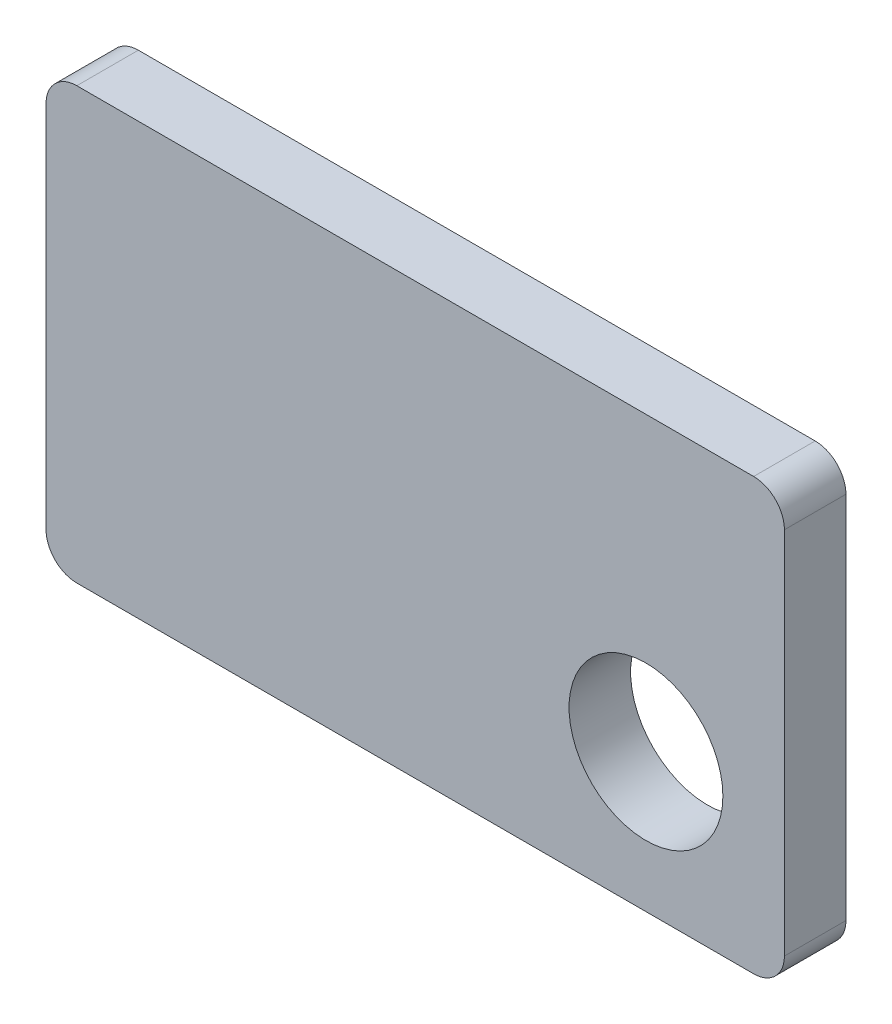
from build123d import *

# Parameters (mm, degrees)
ESQUISSE1_W             = 12
ESQUISSE1_H             = 7
BOSS_EXTRU_1_DEPTH      = 1
CONG_1_R                = 0.5
ENL_V_MAT_EXTRU_1_REACH = 9.018
ESQUISSE2_R             = 1.25


with BuildPart() as part:
    # Esquisse1 → Boss.-Extru.1 (new body)
    with BuildSketch(Plane.XY):
        Rectangle(ESQUISSE1_W, ESQUISSE1_H)
    extrude(amount=BOSS_EXTRU_1_DEPTH)

    # Cong_1
    cong_1_edges = [part.edges().sort_by_distance(p)[0] for p in [
        (6, -3.5, 0.5),
        (-6, -3.5, 0.5),
        (-6, 3.5, 0.5),
        (6, 3.5, 0.5),
    ]]
    fillet(cong_1_edges, radius=CONG_1_R)

    # Esquisse2 → Enl_v. mat.-Extru.1 (cut, up to next)
    with BuildSketch(Plane.XY.offset(1), mode=Mode.PRIVATE) as enl_v_mat_extru_1_sk1:
        with Locations((3.75, -1.25)):
            Circle(ESQUISSE2_R)
    enl_v_mat_extru_1_tool1 = extrude(enl_v_mat_extru_1_sk1.sketch, amount=-ENL_V_MAT_EXTRU_1_REACH, mode=Mode.PRIVATE) & part.part
    add(enl_v_mat_extru_1_tool1.solids().sort_by_distance((3.75, -1.25, 1))[0], mode=Mode.SUBTRACT)


solid = part.part
